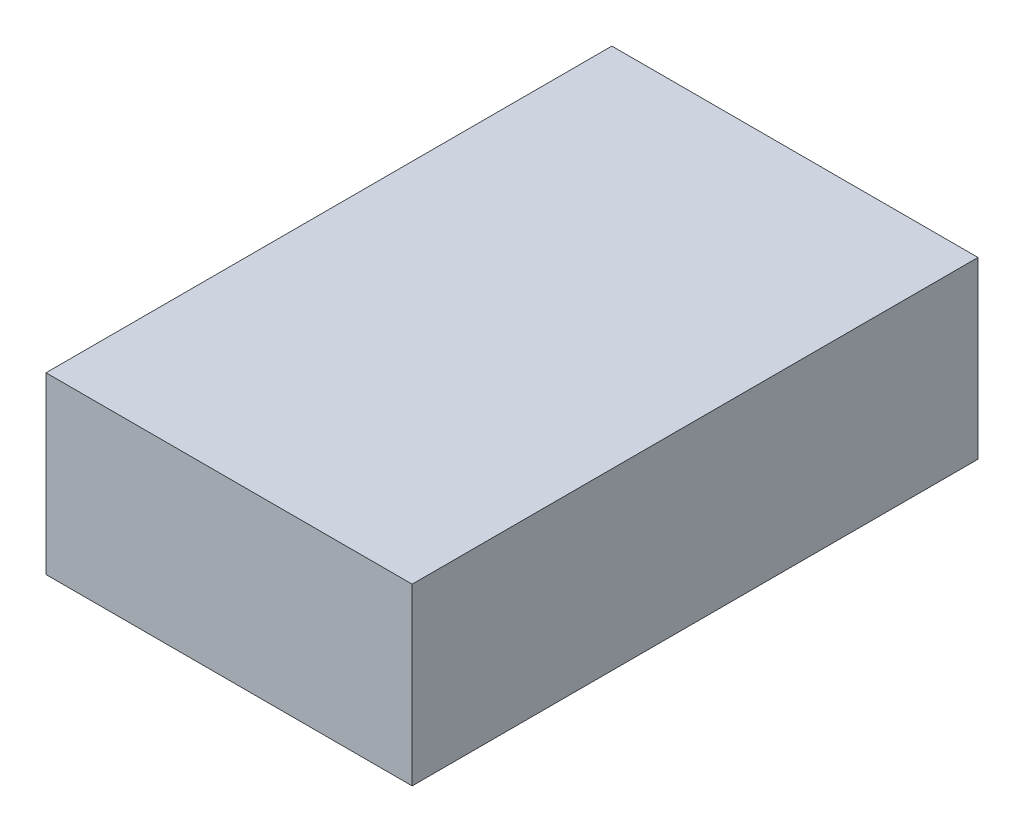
ISO-10303-21;
HEADER;
FILE_DESCRIPTION(('STEP AP214'),'2;1');
FILE_NAME('part.step','',(''),(''),'','','');
FILE_SCHEMA(('AUTOMOTIVE_DESIGN { 1 0 10303 214 1 1 1 1 }'));
ENDSEC;
DATA;
#1=APPLICATION_CONTEXT('core data for automotive mechanical design processes');
#2=APPLICATION_PROTOCOL_DEFINITION('international standard','automotive_design',2000,#1);
#3=PRODUCT_CONTEXT('',#1,'mechanical');
#4=PRODUCT('Part','Part','',(#3));
#5=PRODUCT_RELATED_PRODUCT_CATEGORY('part','',(#4));
#6=PRODUCT_DEFINITION_FORMATION('','',#4);
#7=PRODUCT_DEFINITION_CONTEXT('part definition',#1,'design');
#8=PRODUCT_DEFINITION('design','',#6,#7);
#9=PRODUCT_DEFINITION_SHAPE('','',#8);
#10=(LENGTH_UNIT() NAMED_UNIT(*) SI_UNIT(.MILLI.,.METRE.));
#11=(NAMED_UNIT(*) PLANE_ANGLE_UNIT() SI_UNIT($,.RADIAN.));
#12=(NAMED_UNIT(*) SI_UNIT($,.STERADIAN.) SOLID_ANGLE_UNIT());
#13=UNCERTAINTY_MEASURE_WITH_UNIT(LENGTH_MEASURE(1.E-05),#10,'distance_accuracy_value','');
#14=(GEOMETRIC_REPRESENTATION_CONTEXT(3) GLOBAL_UNCERTAINTY_ASSIGNED_CONTEXT((#13)) GLOBAL_UNIT_ASSIGNED_CONTEXT((#10,
#11,#12)) REPRESENTATION_CONTEXT('',''));
#15=CARTESIAN_POINT('',(0.,0.,0.));
#16=DIRECTION('',(0.,0.,1.));
#17=DIRECTION('',(1.,0.,0.));
#18=AXIS2_PLACEMENT_3D('',#15,#16,#17);
#19=CARTESIAN_POINT('',(0.,21.,0.));
#20=DIRECTION('',(1.,0.,0.));
#21=DIRECTION('',(0.,0.,-1.));
#22=AXIS2_PLACEMENT_3D('',#19,#20,#21);
#23=PLANE('',#22);
#24=DIRECTION('',(0.,0.,1.));
#25=VECTOR('',#24,1.);
#26=CARTESIAN_POINT('',(0.,0.,0.));
#27=LINE('',#26,#25);
#28=CARTESIAN_POINT('',(0.,0.,-68.));
#29=VERTEX_POINT('',#28);
#30=CARTESIAN_POINT('',(0.,0.,0.));
#31=VERTEX_POINT('',#30);
#32=EDGE_CURVE('E104',#29,#31,#27,.T.);
#33=ORIENTED_EDGE('',*,*,#32,.T.);
#34=DIRECTION('',(0.,-1.,0.));
#35=VECTOR('',#34,1.);
#36=CARTESIAN_POINT('',(0.,21.,0.));
#37=LINE('',#36,#35);
#38=CARTESIAN_POINT('',(0.,21.,0.));
#39=VERTEX_POINT('',#38);
#40=EDGE_CURVE('E11',#39,#31,#37,.T.);
#41=ORIENTED_EDGE('',*,*,#40,.F.);
#42=DIRECTION('',(0.,0.,1.));
#43=VECTOR('',#42,1.);
#44=CARTESIAN_POINT('',(0.,21.,0.));
#45=LINE('',#44,#43);
#46=CARTESIAN_POINT('',(0.,21.,-68.));
#47=VERTEX_POINT('',#46);
#48=EDGE_CURVE('E92',#47,#39,#45,.T.);
#49=ORIENTED_EDGE('',*,*,#48,.F.);
#50=DIRECTION('',(0.,-1.,0.));
#51=VECTOR('',#50,1.);
#52=CARTESIAN_POINT('',(0.,21.,-68.));
#53=LINE('',#52,#51);
#54=EDGE_CURVE('E100',#47,#29,#53,.T.);
#55=ORIENTED_EDGE('',*,*,#54,.T.);
#56=EDGE_LOOP('',(#33,#41,#49,#55));
#57=FACE_BOUND('',#56,.T.);
#58=ADVANCED_FACE('F41',(#57),#23,.F.);
#59=CARTESIAN_POINT('',(0.,21.,0.));
#60=DIRECTION('',(0.,0.,-1.));
#61=DIRECTION('',(-1.,0.,0.));
#62=AXIS2_PLACEMENT_3D('',#59,#60,#61);
#63=PLANE('',#62);
#64=DIRECTION('',(1.,0.,0.));
#65=VECTOR('',#64,1.);
#66=CARTESIAN_POINT('',(0.,0.,0.));
#67=LINE('',#66,#65);
#68=CARTESIAN_POINT('',(44.,0.,0.));
#69=VERTEX_POINT('',#68);
#70=EDGE_CURVE('E96',#31,#69,#67,.T.);
#71=ORIENTED_EDGE('',*,*,#70,.T.);
#72=DIRECTION('',(0.,-1.,0.));
#73=VECTOR('',#72,1.);
#74=CARTESIAN_POINT('',(44.,21.,0.));
#75=LINE('',#74,#73);
#76=CARTESIAN_POINT('',(44.,21.,0.));
#77=VERTEX_POINT('',#76);
#78=EDGE_CURVE('E49',#77,#69,#75,.T.);
#79=ORIENTED_EDGE('',*,*,#78,.F.);
#80=DIRECTION('',(1.,0.,0.));
#81=VECTOR('',#80,1.);
#82=CARTESIAN_POINT('',(0.,21.,0.));
#83=LINE('',#82,#81);
#84=EDGE_CURVE('E87',#39,#77,#83,.T.);
#85=ORIENTED_EDGE('',*,*,#84,.F.);
#86=ORIENTED_EDGE('',*,*,#40,.T.);
#87=EDGE_LOOP('',(#71,#79,#85,#86));
#88=FACE_BOUND('',#87,.T.);
#89=ADVANCED_FACE('F95',(#88),#63,.F.);
#90=CARTESIAN_POINT('',(44.,21.,0.));
#91=DIRECTION('',(-1.,0.,0.));
#92=DIRECTION('',(0.,0.,1.));
#93=AXIS2_PLACEMENT_3D('',#90,#91,#92);
#94=PLANE('',#93);
#95=DIRECTION('',(0.,0.,-1.));
#96=VECTOR('',#95,1.);
#97=CARTESIAN_POINT('',(44.,0.,0.));
#98=LINE('',#97,#96);
#99=CARTESIAN_POINT('',(44.,0.,-68.));
#100=VERTEX_POINT('',#99);
#101=EDGE_CURVE('E74',#69,#100,#98,.T.);
#102=ORIENTED_EDGE('',*,*,#101,.T.);
#103=DIRECTION('',(0.,-1.,0.));
#104=VECTOR('',#103,1.);
#105=CARTESIAN_POINT('',(44.,21.,-68.));
#106=LINE('',#105,#104);
#107=CARTESIAN_POINT('',(44.,21.,-68.));
#108=VERTEX_POINT('',#107);
#109=EDGE_CURVE('E97',#108,#100,#106,.T.);
#110=ORIENTED_EDGE('',*,*,#109,.F.);
#111=DIRECTION('',(0.,0.,-1.));
#112=VECTOR('',#111,1.);
#113=CARTESIAN_POINT('',(44.,21.,0.));
#114=LINE('',#113,#112);
#115=EDGE_CURVE('E90',#77,#108,#114,.T.);
#116=ORIENTED_EDGE('',*,*,#115,.F.);
#117=ORIENTED_EDGE('',*,*,#78,.T.);
#118=EDGE_LOOP('',(#102,#110,#116,#117));
#119=FACE_BOUND('',#118,.T.);
#120=ADVANCED_FACE('F98',(#119),#94,.F.);
#121=CARTESIAN_POINT('',(0.,21.,-68.));
#122=DIRECTION('',(0.,0.,1.));
#123=DIRECTION('',(1.,0.,0.));
#124=AXIS2_PLACEMENT_3D('',#121,#122,#123);
#125=PLANE('',#124);
#126=DIRECTION('',(-1.,0.,0.));
#127=VECTOR('',#126,1.);
#128=CARTESIAN_POINT('',(0.,0.,-68.));
#129=LINE('',#128,#127);
#130=EDGE_CURVE('E80',#100,#29,#129,.T.);
#131=ORIENTED_EDGE('',*,*,#130,.T.);
#132=ORIENTED_EDGE('',*,*,#54,.F.);
#133=DIRECTION('',(-1.,0.,0.));
#134=VECTOR('',#133,1.);
#135=CARTESIAN_POINT('',(0.,21.,-68.));
#136=LINE('',#135,#134);
#137=EDGE_CURVE('E57',#108,#47,#136,.T.);
#138=ORIENTED_EDGE('',*,*,#137,.F.);
#139=ORIENTED_EDGE('',*,*,#109,.T.);
#140=EDGE_LOOP('',(#131,#132,#138,#139));
#141=FACE_BOUND('',#140,.T.);
#142=ADVANCED_FACE('F111',(#141),#125,.F.);
#143=CARTESIAN_POINT('',(0.,21.,0.));
#144=DIRECTION('',(0.,-1.,0.));
#145=DIRECTION('',(0.,0.,-1.));
#146=AXIS2_PLACEMENT_3D('',#143,#144,#145);
#147=PLANE('',#146);
#148=ORIENTED_EDGE('',*,*,#48,.T.);
#149=ORIENTED_EDGE('',*,*,#84,.T.);
#150=ORIENTED_EDGE('',*,*,#115,.T.);
#151=ORIENTED_EDGE('',*,*,#137,.T.);
#152=EDGE_LOOP('',(#148,#149,#150,#151));
#153=FACE_BOUND('',#152,.T.);
#154=ADVANCED_FACE('F88',(#153),#147,.F.);
#155=CARTESIAN_POINT('',(0.,0.,0.));
#156=DIRECTION('',(0.,-1.,0.));
#157=DIRECTION('',(0.,0.,-1.));
#158=AXIS2_PLACEMENT_3D('',#155,#156,#157);
#159=PLANE('',#158);
#160=ORIENTED_EDGE('',*,*,#32,.F.);
#161=ORIENTED_EDGE('',*,*,#130,.F.);
#162=ORIENTED_EDGE('',*,*,#101,.F.);
#163=ORIENTED_EDGE('',*,*,#70,.F.);
#164=EDGE_LOOP('',(#160,#161,#162,#163));
#165=FACE_BOUND('',#164,.T.);
#166=ADVANCED_FACE('F114',(#165),#159,.T.);
#167=CLOSED_SHELL('',(#58,#89,#120,#142,#154,#166));
#168=MANIFOLD_SOLID_BREP('B2',#167);
#169=ADVANCED_BREP_SHAPE_REPRESENTATION('',(#18,#168),#14);
#170=SHAPE_DEFINITION_REPRESENTATION(#9,#169);
ENDSEC;
END-ISO-10303-21;
